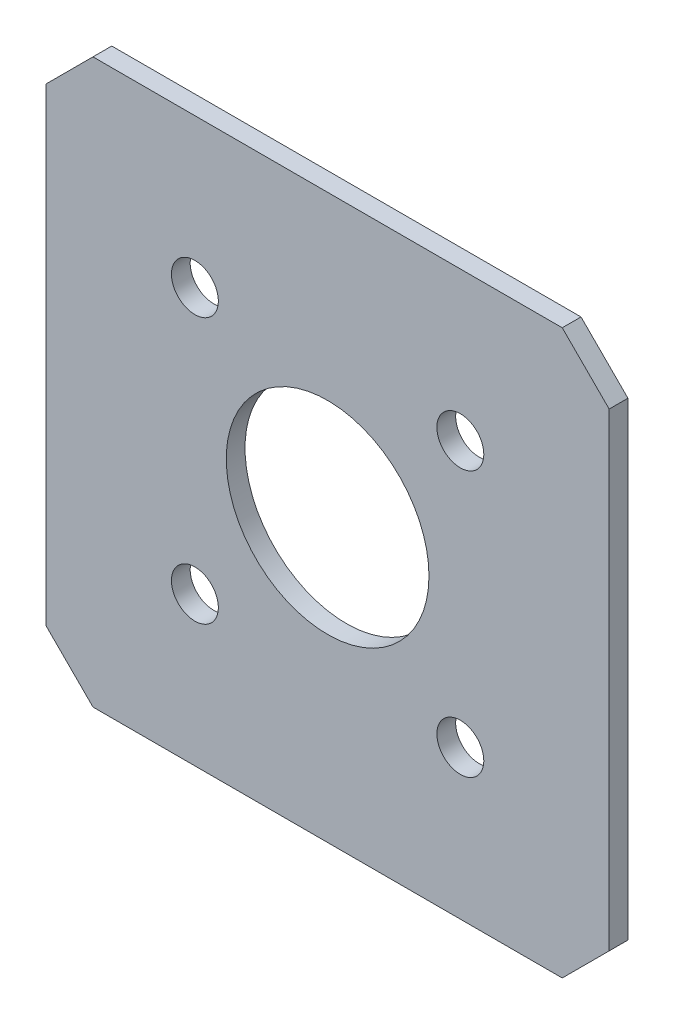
ISO-10303-21;
HEADER;
FILE_DESCRIPTION(('STEP AP214'),'2;1');
FILE_NAME('part.step','',(''),(''),'','','');
FILE_SCHEMA(('AUTOMOTIVE_DESIGN { 1 0 10303 214 1 1 1 1 }'));
ENDSEC;
DATA;
#1=APPLICATION_CONTEXT('core data for automotive mechanical design processes');
#2=APPLICATION_PROTOCOL_DEFINITION('international standard','automotive_design',2000,#1);
#3=PRODUCT_CONTEXT('',#1,'mechanical');
#4=PRODUCT('Part','Part','',(#3));
#5=PRODUCT_RELATED_PRODUCT_CATEGORY('part','',(#4));
#6=PRODUCT_DEFINITION_FORMATION('','',#4);
#7=PRODUCT_DEFINITION_CONTEXT('part definition',#1,'design');
#8=PRODUCT_DEFINITION('design','',#6,#7);
#9=PRODUCT_DEFINITION_SHAPE('','',#8);
#10=(LENGTH_UNIT() NAMED_UNIT(*) SI_UNIT(.MILLI.,.METRE.));
#11=(NAMED_UNIT(*) PLANE_ANGLE_UNIT() SI_UNIT($,.RADIAN.));
#12=(NAMED_UNIT(*) SI_UNIT($,.STERADIAN.) SOLID_ANGLE_UNIT());
#13=UNCERTAINTY_MEASURE_WITH_UNIT(LENGTH_MEASURE(1.E-05),#10,'distance_accuracy_value','');
#14=(GEOMETRIC_REPRESENTATION_CONTEXT(3) GLOBAL_UNCERTAINTY_ASSIGNED_CONTEXT((#13)) GLOBAL_UNIT_ASSIGNED_CONTEXT((#10,
#11,#12)) REPRESENTATION_CONTEXT('',''));
#15=CARTESIAN_POINT('',(0.,0.,0.));
#16=DIRECTION('',(0.,0.,1.));
#17=DIRECTION('',(1.,0.,0.));
#18=AXIS2_PLACEMENT_3D('',#15,#16,#17);
#19=CARTESIAN_POINT('',(0.,0.,10.));
#20=DIRECTION('',(0.,0.,-1.));
#21=DIRECTION('',(-1.,0.,0.));
#22=AXIS2_PLACEMENT_3D('',#19,#20,#21);
#23=PLANE('',#22);
#24=CARTESIAN_POINT('',(-70.7106781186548,-70.7106781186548,10.));
#25=DIRECTION('',(0.,0.,1.));
#26=DIRECTION('',(1.,0.,0.));
#27=AXIS2_PLACEMENT_3D('',#24,#25,#26);
#28=CIRCLE('',#27,12.5);
#29=CARTESIAN_POINT('',(-58.2106781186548,-70.7106781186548,10.));
#30=VERTEX_POINT('',#29);
#31=EDGE_CURVE('E197',#30,#30,#28,.T.);
#32=ORIENTED_EDGE('',*,*,#31,.F.);
#33=EDGE_LOOP('',(#32));
#34=FACE_BOUND('',#33,.T.);
#35=CARTESIAN_POINT('',(70.7106781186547,70.7106781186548,10.));
#36=DIRECTION('',(0.,0.,1.));
#37=DIRECTION('',(1.,0.,0.));
#38=AXIS2_PLACEMENT_3D('',#35,#36,#37);
#39=CIRCLE('',#38,12.5);
#40=CARTESIAN_POINT('',(83.2106781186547,70.7106781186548,10.));
#41=VERTEX_POINT('',#40);
#42=EDGE_CURVE('E185',#41,#41,#39,.T.);
#43=ORIENTED_EDGE('',*,*,#42,.F.);
#44=EDGE_LOOP('',(#43));
#45=FACE_BOUND('',#44,.T.);
#46=DIRECTION('',(-1.,0.,0.));
#47=VECTOR('',#46,1.);
#48=CARTESIAN_POINT('',(-125.,150.,10.));
#49=LINE('',#48,#47);
#50=CARTESIAN_POINT('',(125.,150.,10.));
#51=VERTEX_POINT('',#50);
#52=CARTESIAN_POINT('',(-125.,150.,10.));
#53=VERTEX_POINT('',#52);
#54=EDGE_CURVE('E148',#51,#53,#49,.T.);
#55=ORIENTED_EDGE('',*,*,#54,.T.);
#56=DIRECTION('',(-0.707106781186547,-0.707106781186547,0.));
#57=VECTOR('',#56,1.);
#58=CARTESIAN_POINT('',(-150.,125.,10.));
#59=LINE('',#58,#57);
#60=CARTESIAN_POINT('',(-150.,125.,10.));
#61=VERTEX_POINT('',#60);
#62=EDGE_CURVE('E96',#53,#61,#59,.T.);
#63=ORIENTED_EDGE('',*,*,#62,.T.);
#64=DIRECTION('',(0.,-1.,0.));
#65=VECTOR('',#64,1.);
#66=CARTESIAN_POINT('',(-150.,125.,10.));
#67=LINE('',#66,#65);
#68=CARTESIAN_POINT('',(-150.,-125.,10.));
#69=VERTEX_POINT('',#68);
#70=EDGE_CURVE('E163',#61,#69,#67,.T.);
#71=ORIENTED_EDGE('',*,*,#70,.T.);
#72=DIRECTION('',(0.707106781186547,-0.707106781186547,0.));
#73=VECTOR('',#72,1.);
#74=CARTESIAN_POINT('',(-150.,-125.,10.));
#75=LINE('',#74,#73);
#76=CARTESIAN_POINT('',(-125.,-150.,10.));
#77=VERTEX_POINT('',#76);
#78=EDGE_CURVE('E176',#69,#77,#75,.T.);
#79=ORIENTED_EDGE('',*,*,#78,.T.);
#80=DIRECTION('',(1.,0.,0.));
#81=VECTOR('',#80,1.);
#82=CARTESIAN_POINT('',(-125.,-150.,10.));
#83=LINE('',#82,#81);
#84=CARTESIAN_POINT('',(125.,-150.,10.));
#85=VERTEX_POINT('',#84);
#86=EDGE_CURVE('E115',#77,#85,#83,.T.);
#87=ORIENTED_EDGE('',*,*,#86,.T.);
#88=DIRECTION('',(0.707106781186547,0.707106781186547,0.));
#89=VECTOR('',#88,1.);
#90=CARTESIAN_POINT('',(125.,-150.,10.));
#91=LINE('',#90,#89);
#92=CARTESIAN_POINT('',(150.,-125.,10.));
#93=VERTEX_POINT('',#92);
#94=EDGE_CURVE('E109',#85,#93,#91,.T.);
#95=ORIENTED_EDGE('',*,*,#94,.T.);
#96=DIRECTION('',(0.,1.,0.));
#97=VECTOR('',#96,1.);
#98=CARTESIAN_POINT('',(150.,125.,10.));
#99=LINE('',#98,#97);
#100=CARTESIAN_POINT('',(150.,125.,10.));
#101=VERTEX_POINT('',#100);
#102=EDGE_CURVE('E113',#93,#101,#99,.T.);
#103=ORIENTED_EDGE('',*,*,#102,.T.);
#104=DIRECTION('',(-0.707106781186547,0.707106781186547,0.));
#105=VECTOR('',#104,1.);
#106=CARTESIAN_POINT('',(125.,150.,10.));
#107=LINE('',#106,#105);
#108=EDGE_CURVE('E53',#101,#51,#107,.T.);
#109=ORIENTED_EDGE('',*,*,#108,.T.);
#110=EDGE_LOOP('',(#55,#63,#71,#79,#87,#95,#103,#109));
#111=FACE_BOUND('',#110,.T.);
#112=CARTESIAN_POINT('',(-70.7106781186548,70.7106781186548,10.));
#113=DIRECTION('',(0.,0.,1.));
#114=DIRECTION('',(1.,0.,0.));
#115=AXIS2_PLACEMENT_3D('',#112,#113,#114);
#116=CIRCLE('',#115,12.5);
#117=CARTESIAN_POINT('',(-58.2106781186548,70.7106781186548,10.));
#118=VERTEX_POINT('',#117);
#119=EDGE_CURVE('E137',#118,#118,#116,.T.);
#120=ORIENTED_EDGE('',*,*,#119,.F.);
#121=EDGE_LOOP('',(#120));
#122=FACE_BOUND('',#121,.T.);
#123=CARTESIAN_POINT('',(70.7106781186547,-70.7106781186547,10.));
#124=DIRECTION('',(0.,0.,1.));
#125=DIRECTION('',(1.,0.,0.));
#126=AXIS2_PLACEMENT_3D('',#123,#124,#125);
#127=CIRCLE('',#126,12.5);
#128=CARTESIAN_POINT('',(83.2106781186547,-70.7106781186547,10.));
#129=VERTEX_POINT('',#128);
#130=EDGE_CURVE('E191',#129,#129,#127,.T.);
#131=ORIENTED_EDGE('',*,*,#130,.F.);
#132=EDGE_LOOP('',(#131));
#133=FACE_BOUND('',#132,.T.);
#134=CARTESIAN_POINT('',(0.,0.,10.));
#135=DIRECTION('',(0.,0.,1.));
#136=DIRECTION('',(1.,0.,0.));
#137=AXIS2_PLACEMENT_3D('',#134,#135,#136);
#138=CIRCLE('',#137,54.);
#139=CARTESIAN_POINT('',(54.,0.,10.));
#140=VERTEX_POINT('',#139);
#141=EDGE_CURVE('E203',#140,#140,#138,.T.);
#142=ORIENTED_EDGE('',*,*,#141,.F.);
#143=EDGE_LOOP('',(#142));
#144=FACE_BOUND('',#143,.T.);
#145=ADVANCED_FACE('F36',(#34,#45,#111,#122,#133,#144),#23,.F.);
#146=CARTESIAN_POINT('',(0.,0.,0.));
#147=DIRECTION('',(0.,0.,-1.));
#148=DIRECTION('',(-1.,0.,0.));
#149=AXIS2_PLACEMENT_3D('',#146,#147,#148);
#150=PLANE('',#149);
#151=CARTESIAN_POINT('',(-70.7106781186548,-70.7106781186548,0.));
#152=DIRECTION('',(0.,0.,1.));
#153=DIRECTION('',(1.,0.,0.));
#154=AXIS2_PLACEMENT_3D('',#151,#152,#153);
#155=CIRCLE('',#154,12.5);
#156=CARTESIAN_POINT('',(-58.2106781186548,-70.7106781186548,0.));
#157=VERTEX_POINT('',#156);
#158=EDGE_CURVE('E200',#157,#157,#155,.T.);
#159=ORIENTED_EDGE('',*,*,#158,.T.);
#160=EDGE_LOOP('',(#159));
#161=FACE_BOUND('',#160,.T.);
#162=CARTESIAN_POINT('',(70.7106781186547,70.7106781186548,0.));
#163=DIRECTION('',(0.,0.,1.));
#164=DIRECTION('',(1.,0.,0.));
#165=AXIS2_PLACEMENT_3D('',#162,#163,#164);
#166=CIRCLE('',#165,12.5);
#167=CARTESIAN_POINT('',(83.2106781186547,70.7106781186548,0.));
#168=VERTEX_POINT('',#167);
#169=EDGE_CURVE('E188',#168,#168,#166,.T.);
#170=ORIENTED_EDGE('',*,*,#169,.T.);
#171=EDGE_LOOP('',(#170));
#172=FACE_BOUND('',#171,.T.);
#173=DIRECTION('',(-1.,0.,0.));
#174=VECTOR('',#173,1.);
#175=CARTESIAN_POINT('',(-125.,150.,0.));
#176=LINE('',#175,#174);
#177=CARTESIAN_POINT('',(125.,150.,0.));
#178=VERTEX_POINT('',#177);
#179=CARTESIAN_POINT('',(-125.,150.,0.));
#180=VERTEX_POINT('',#179);
#181=EDGE_CURVE('E133',#178,#180,#176,.T.);
#182=ORIENTED_EDGE('',*,*,#181,.F.);
#183=DIRECTION('',(-0.707106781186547,0.707106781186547,0.));
#184=VECTOR('',#183,1.);
#185=CARTESIAN_POINT('',(125.,150.,0.));
#186=LINE('',#185,#184);
#187=CARTESIAN_POINT('',(150.,125.,0.));
#188=VERTEX_POINT('',#187);
#189=EDGE_CURVE('E88',#188,#178,#186,.T.);
#190=ORIENTED_EDGE('',*,*,#189,.F.);
#191=DIRECTION('',(0.,1.,0.));
#192=VECTOR('',#191,1.);
#193=CARTESIAN_POINT('',(150.,125.,0.));
#194=LINE('',#193,#192);
#195=CARTESIAN_POINT('',(150.,-125.,0.));
#196=VERTEX_POINT('',#195);
#197=EDGE_CURVE('E82',#196,#188,#194,.T.);
#198=ORIENTED_EDGE('',*,*,#197,.F.);
#199=DIRECTION('',(0.707106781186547,0.707106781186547,0.));
#200=VECTOR('',#199,1.);
#201=CARTESIAN_POINT('',(125.,-150.,0.));
#202=LINE('',#201,#200);
#203=CARTESIAN_POINT('',(125.,-150.,0.));
#204=VERTEX_POINT('',#203);
#205=EDGE_CURVE('E123',#204,#196,#202,.T.);
#206=ORIENTED_EDGE('',*,*,#205,.F.);
#207=DIRECTION('',(1.,0.,0.));
#208=VECTOR('',#207,1.);
#209=CARTESIAN_POINT('',(-125.,-150.,0.));
#210=LINE('',#209,#208);
#211=CARTESIAN_POINT('',(-125.,-150.,0.));
#212=VERTEX_POINT('',#211);
#213=EDGE_CURVE('E143',#212,#204,#210,.T.);
#214=ORIENTED_EDGE('',*,*,#213,.F.);
#215=DIRECTION('',(0.707106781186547,-0.707106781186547,0.));
#216=VECTOR('',#215,1.);
#217=CARTESIAN_POINT('',(-150.,-125.,0.));
#218=LINE('',#217,#216);
#219=CARTESIAN_POINT('',(-150.,-125.,0.));
#220=VERTEX_POINT('',#219);
#221=EDGE_CURVE('E141',#220,#212,#218,.T.);
#222=ORIENTED_EDGE('',*,*,#221,.F.);
#223=DIRECTION('',(0.,-1.,0.));
#224=VECTOR('',#223,1.);
#225=CARTESIAN_POINT('',(-150.,125.,0.));
#226=LINE('',#225,#224);
#227=CARTESIAN_POINT('',(-150.,125.,0.));
#228=VERTEX_POINT('',#227);
#229=EDGE_CURVE('E139',#228,#220,#226,.T.);
#230=ORIENTED_EDGE('',*,*,#229,.F.);
#231=DIRECTION('',(-0.707106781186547,-0.707106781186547,0.));
#232=VECTOR('',#231,1.);
#233=CARTESIAN_POINT('',(-150.,125.,0.));
#234=LINE('',#233,#232);
#235=EDGE_CURVE('E136',#180,#228,#234,.T.);
#236=ORIENTED_EDGE('',*,*,#235,.F.);
#237=EDGE_LOOP('',(#182,#190,#198,#206,#214,#222,#230,#236));
#238=FACE_BOUND('',#237,.T.);
#239=CARTESIAN_POINT('',(-70.7106781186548,70.7106781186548,0.));
#240=DIRECTION('',(0.,0.,1.));
#241=DIRECTION('',(1.,0.,0.));
#242=AXIS2_PLACEMENT_3D('',#239,#240,#241);
#243=CIRCLE('',#242,12.5);
#244=CARTESIAN_POINT('',(-58.2106781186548,70.7106781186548,0.));
#245=VERTEX_POINT('',#244);
#246=EDGE_CURVE('E182',#245,#245,#243,.T.);
#247=ORIENTED_EDGE('',*,*,#246,.T.);
#248=EDGE_LOOP('',(#247));
#249=FACE_BOUND('',#248,.T.);
#250=CARTESIAN_POINT('',(70.7106781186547,-70.7106781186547,0.));
#251=DIRECTION('',(0.,0.,1.));
#252=DIRECTION('',(1.,0.,0.));
#253=AXIS2_PLACEMENT_3D('',#250,#251,#252);
#254=CIRCLE('',#253,12.5);
#255=CARTESIAN_POINT('',(83.2106781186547,-70.7106781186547,0.));
#256=VERTEX_POINT('',#255);
#257=EDGE_CURVE('E194',#256,#256,#254,.T.);
#258=ORIENTED_EDGE('',*,*,#257,.T.);
#259=EDGE_LOOP('',(#258));
#260=FACE_BOUND('',#259,.T.);
#261=CARTESIAN_POINT('',(0.,0.,0.));
#262=DIRECTION('',(0.,0.,1.));
#263=DIRECTION('',(1.,0.,0.));
#264=AXIS2_PLACEMENT_3D('',#261,#262,#263);
#265=CIRCLE('',#264,54.);
#266=CARTESIAN_POINT('',(54.,0.,0.));
#267=VERTEX_POINT('',#266);
#268=EDGE_CURVE('E206',#267,#267,#265,.T.);
#269=ORIENTED_EDGE('',*,*,#268,.T.);
#270=EDGE_LOOP('',(#269));
#271=FACE_BOUND('',#270,.T.);
#272=ADVANCED_FACE('F167',(#161,#172,#238,#249,#260,#271),#150,.T.);
#273=CARTESIAN_POINT('',(-125.,150.,10.));
#274=DIRECTION('',(0.,-1.,0.));
#275=DIRECTION('',(0.,0.,-1.));
#276=AXIS2_PLACEMENT_3D('',#273,#274,#275);
#277=PLANE('',#276);
#278=ORIENTED_EDGE('',*,*,#181,.T.);
#279=DIRECTION('',(0.,0.,-1.));
#280=VECTOR('',#279,1.);
#281=CARTESIAN_POINT('',(-125.,150.,10.));
#282=LINE('',#281,#280);
#283=EDGE_CURVE('E11',#53,#180,#282,.T.);
#284=ORIENTED_EDGE('',*,*,#283,.F.);
#285=ORIENTED_EDGE('',*,*,#54,.F.);
#286=DIRECTION('',(0.,0.,-1.));
#287=VECTOR('',#286,1.);
#288=CARTESIAN_POINT('',(125.,150.,10.));
#289=LINE('',#288,#287);
#290=EDGE_CURVE('E129',#51,#178,#289,.T.);
#291=ORIENTED_EDGE('',*,*,#290,.T.);
#292=EDGE_LOOP('',(#278,#284,#285,#291));
#293=FACE_BOUND('',#292,.T.);
#294=ADVANCED_FACE('F38',(#293),#277,.F.);
#295=CARTESIAN_POINT('',(-150.,125.,10.));
#296=DIRECTION('',(0.707106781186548,-0.707106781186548,0.));
#297=DIRECTION('',(0.707106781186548,0.707106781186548,0.));
#298=AXIS2_PLACEMENT_3D('',#295,#296,#297);
#299=PLANE('',#298);
#300=ORIENTED_EDGE('',*,*,#235,.T.);
#301=DIRECTION('',(0.,0.,-1.));
#302=VECTOR('',#301,1.);
#303=CARTESIAN_POINT('',(-150.,125.,10.));
#304=LINE('',#303,#302);
#305=EDGE_CURVE('E45',#61,#228,#304,.T.);
#306=ORIENTED_EDGE('',*,*,#305,.F.);
#307=ORIENTED_EDGE('',*,*,#62,.F.);
#308=ORIENTED_EDGE('',*,*,#283,.T.);
#309=EDGE_LOOP('',(#300,#306,#307,#308));
#310=FACE_BOUND('',#309,.T.);
#311=ADVANCED_FACE('F241',(#310),#299,.F.);
#312=CARTESIAN_POINT('',(-150.,125.,10.));
#313=DIRECTION('',(1.,0.,0.));
#314=DIRECTION('',(0.,1.,0.));
#315=AXIS2_PLACEMENT_3D('',#312,#313,#314);
#316=PLANE('',#315);
#317=ORIENTED_EDGE('',*,*,#229,.T.);
#318=DIRECTION('',(0.,0.,-1.));
#319=VECTOR('',#318,1.);
#320=CARTESIAN_POINT('',(-150.,-125.,10.));
#321=LINE('',#320,#319);
#322=EDGE_CURVE('E155',#69,#220,#321,.T.);
#323=ORIENTED_EDGE('',*,*,#322,.F.);
#324=ORIENTED_EDGE('',*,*,#70,.F.);
#325=ORIENTED_EDGE('',*,*,#305,.T.);
#326=EDGE_LOOP('',(#317,#323,#324,#325));
#327=FACE_BOUND('',#326,.T.);
#328=ADVANCED_FACE('F161',(#327),#316,.F.);
#329=CARTESIAN_POINT('',(-150.,-125.,10.));
#330=DIRECTION('',(0.707106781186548,0.707106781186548,0.));
#331=DIRECTION('',(-0.707106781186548,0.707106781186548,0.));
#332=AXIS2_PLACEMENT_3D('',#329,#330,#331);
#333=PLANE('',#332);
#334=ORIENTED_EDGE('',*,*,#221,.T.);
#335=DIRECTION('',(0.,0.,-1.));
#336=VECTOR('',#335,1.);
#337=CARTESIAN_POINT('',(-125.,-150.,10.));
#338=LINE('',#337,#336);
#339=EDGE_CURVE('E152',#77,#212,#338,.T.);
#340=ORIENTED_EDGE('',*,*,#339,.F.);
#341=ORIENTED_EDGE('',*,*,#78,.F.);
#342=ORIENTED_EDGE('',*,*,#322,.T.);
#343=EDGE_LOOP('',(#334,#340,#341,#342));
#344=FACE_BOUND('',#343,.T.);
#345=ADVANCED_FACE('F172',(#344),#333,.F.);
#346=CARTESIAN_POINT('',(-125.,-150.,10.));
#347=DIRECTION('',(0.,1.,0.));
#348=DIRECTION('',(0.,0.,1.));
#349=AXIS2_PLACEMENT_3D('',#346,#347,#348);
#350=PLANE('',#349);
#351=ORIENTED_EDGE('',*,*,#213,.T.);
#352=DIRECTION('',(0.,0.,-1.));
#353=VECTOR('',#352,1.);
#354=CARTESIAN_POINT('',(125.,-150.,10.));
#355=LINE('',#354,#353);
#356=EDGE_CURVE('E124',#85,#204,#355,.T.);
#357=ORIENTED_EDGE('',*,*,#356,.F.);
#358=ORIENTED_EDGE('',*,*,#86,.F.);
#359=ORIENTED_EDGE('',*,*,#339,.T.);
#360=EDGE_LOOP('',(#351,#357,#358,#359));
#361=FACE_BOUND('',#360,.T.);
#362=ADVANCED_FACE('F175',(#361),#350,.F.);
#363=CARTESIAN_POINT('',(125.,-150.,10.));
#364=DIRECTION('',(-0.707106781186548,0.707106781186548,0.));
#365=DIRECTION('',(-0.707106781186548,-0.707106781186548,0.));
#366=AXIS2_PLACEMENT_3D('',#363,#364,#365);
#367=PLANE('',#366);
#368=ORIENTED_EDGE('',*,*,#205,.T.);
#369=DIRECTION('',(0.,0.,-1.));
#370=VECTOR('',#369,1.);
#371=CARTESIAN_POINT('',(150.,-125.,10.));
#372=LINE('',#371,#370);
#373=EDGE_CURVE('E120',#93,#196,#372,.T.);
#374=ORIENTED_EDGE('',*,*,#373,.F.);
#375=ORIENTED_EDGE('',*,*,#94,.F.);
#376=ORIENTED_EDGE('',*,*,#356,.T.);
#377=EDGE_LOOP('',(#368,#374,#375,#376));
#378=FACE_BOUND('',#377,.T.);
#379=ADVANCED_FACE('F121',(#378),#367,.F.);
#380=CARTESIAN_POINT('',(150.,125.,10.));
#381=DIRECTION('',(-1.,0.,0.));
#382=DIRECTION('',(0.,-1.,0.));
#383=AXIS2_PLACEMENT_3D('',#380,#381,#382);
#384=PLANE('',#383);
#385=ORIENTED_EDGE('',*,*,#197,.T.);
#386=DIRECTION('',(0.,0.,-1.));
#387=VECTOR('',#386,1.);
#388=CARTESIAN_POINT('',(150.,125.,10.));
#389=LINE('',#388,#387);
#390=EDGE_CURVE('E125',#101,#188,#389,.T.);
#391=ORIENTED_EDGE('',*,*,#390,.F.);
#392=ORIENTED_EDGE('',*,*,#102,.F.);
#393=ORIENTED_EDGE('',*,*,#373,.T.);
#394=EDGE_LOOP('',(#385,#391,#392,#393));
#395=FACE_BOUND('',#394,.T.);
#396=ADVANCED_FACE('F127',(#395),#384,.F.);
#397=CARTESIAN_POINT('',(125.,150.,10.));
#398=DIRECTION('',(-0.707106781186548,-0.707106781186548,0.));
#399=DIRECTION('',(0.707106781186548,-0.707106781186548,0.));
#400=AXIS2_PLACEMENT_3D('',#397,#398,#399);
#401=PLANE('',#400);
#402=ORIENTED_EDGE('',*,*,#189,.T.);
#403=ORIENTED_EDGE('',*,*,#290,.F.);
#404=ORIENTED_EDGE('',*,*,#108,.F.);
#405=ORIENTED_EDGE('',*,*,#390,.T.);
#406=EDGE_LOOP('',(#402,#403,#404,#405));
#407=FACE_BOUND('',#406,.T.);
#408=ADVANCED_FACE('F229',(#407),#401,.F.);
#409=CARTESIAN_POINT('',(-70.7106781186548,70.7106781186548,10.));
#410=DIRECTION('',(0.,0.,-1.));
#411=DIRECTION('',(-1.,0.,0.));
#412=AXIS2_PLACEMENT_3D('',#409,#410,#411);
#413=CYLINDRICAL_SURFACE('',#412,12.5);
#414=ORIENTED_EDGE('',*,*,#119,.T.);
#415=EDGE_LOOP('',(#414));
#416=FACE_BOUND('',#415,.T.);
#417=ORIENTED_EDGE('',*,*,#246,.F.);
#418=EDGE_LOOP('',(#417));
#419=FACE_BOUND('',#418,.T.);
#420=ADVANCED_FACE('F226',(#416,#419),#413,.F.);
#421=CARTESIAN_POINT('',(70.7106781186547,70.7106781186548,10.));
#422=DIRECTION('',(0.,0.,-1.));
#423=DIRECTION('',(-1.,0.,0.));
#424=AXIS2_PLACEMENT_3D('',#421,#422,#423);
#425=CYLINDRICAL_SURFACE('',#424,12.5);
#426=ORIENTED_EDGE('',*,*,#42,.T.);
#427=EDGE_LOOP('',(#426));
#428=FACE_BOUND('',#427,.T.);
#429=ORIENTED_EDGE('',*,*,#169,.F.);
#430=EDGE_LOOP('',(#429));
#431=FACE_BOUND('',#430,.T.);
#432=ADVANCED_FACE('F305',(#428,#431),#425,.F.);
#433=CARTESIAN_POINT('',(70.7106781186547,-70.7106781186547,10.));
#434=DIRECTION('',(0.,0.,-1.));
#435=DIRECTION('',(-1.,0.,0.));
#436=AXIS2_PLACEMENT_3D('',#433,#434,#435);
#437=CYLINDRICAL_SURFACE('',#436,12.5);
#438=ORIENTED_EDGE('',*,*,#130,.T.);
#439=EDGE_LOOP('',(#438));
#440=FACE_BOUND('',#439,.T.);
#441=ORIENTED_EDGE('',*,*,#257,.F.);
#442=EDGE_LOOP('',(#441));
#443=FACE_BOUND('',#442,.T.);
#444=ADVANCED_FACE('F313',(#440,#443),#437,.F.);
#445=CARTESIAN_POINT('',(-70.7106781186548,-70.7106781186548,10.));
#446=DIRECTION('',(0.,0.,-1.));
#447=DIRECTION('',(-1.,0.,0.));
#448=AXIS2_PLACEMENT_3D('',#445,#446,#447);
#449=CYLINDRICAL_SURFACE('',#448,12.5);
#450=ORIENTED_EDGE('',*,*,#31,.T.);
#451=EDGE_LOOP('',(#450));
#452=FACE_BOUND('',#451,.T.);
#453=ORIENTED_EDGE('',*,*,#158,.F.);
#454=EDGE_LOOP('',(#453));
#455=FACE_BOUND('',#454,.T.);
#456=ADVANCED_FACE('F321',(#452,#455),#449,.F.);
#457=CARTESIAN_POINT('',(0.,0.,10.));
#458=DIRECTION('',(0.,0.,-1.));
#459=DIRECTION('',(-1.,0.,0.));
#460=AXIS2_PLACEMENT_3D('',#457,#458,#459);
#461=CYLINDRICAL_SURFACE('',#460,54.);
#462=ORIENTED_EDGE('',*,*,#141,.T.);
#463=EDGE_LOOP('',(#462));
#464=FACE_BOUND('',#463,.T.);
#465=ORIENTED_EDGE('',*,*,#268,.F.);
#466=EDGE_LOOP('',(#465));
#467=FACE_BOUND('',#466,.T.);
#468=ADVANCED_FACE('F212',(#464,#467),#461,.F.);
#469=CLOSED_SHELL('',(#145,#272,#294,#311,#328,#345,#362,#379,#396,#408,#420,#432,#444,#456,#468));
#470=MANIFOLD_SOLID_BREP('B2',#469);
#471=ADVANCED_BREP_SHAPE_REPRESENTATION('',(#18,#470),#14);
#472=SHAPE_DEFINITION_REPRESENTATION(#9,#471);
ENDSEC;
END-ISO-10303-21;
